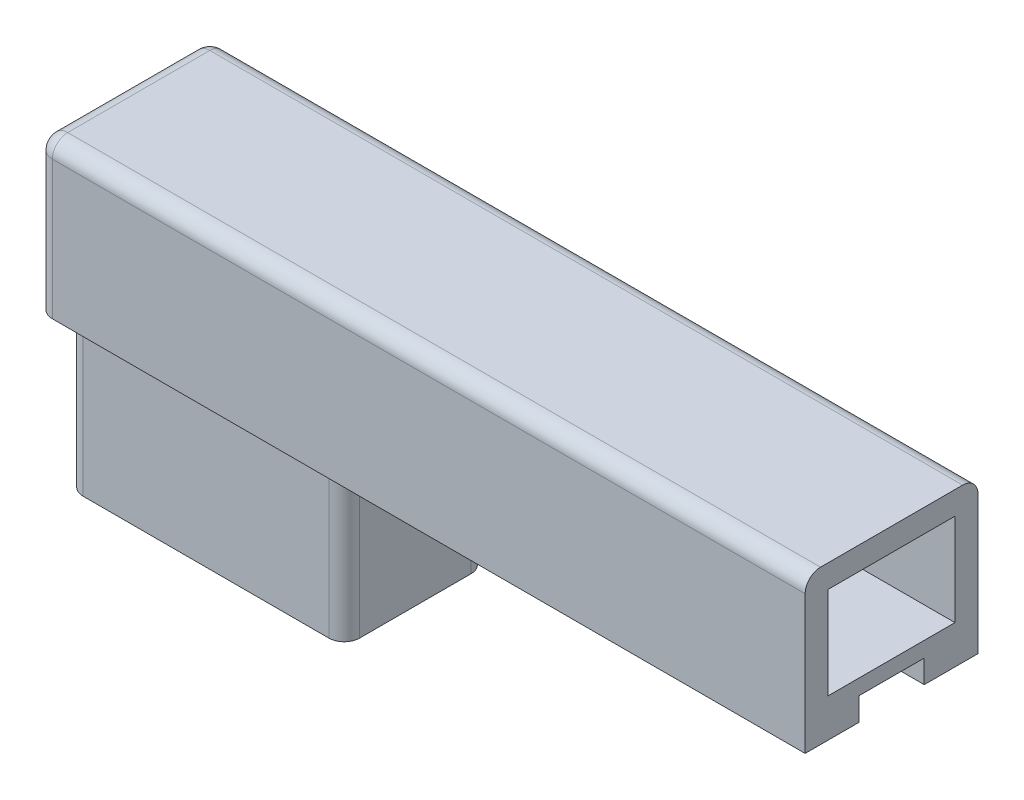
ISO-10303-21;
HEADER;
FILE_DESCRIPTION(('STEP AP214'),'2;1');
FILE_NAME('part.step','',(''),(''),'','','');
FILE_SCHEMA(('AUTOMOTIVE_DESIGN { 1 0 10303 214 1 1 1 1 }'));
ENDSEC;
DATA;
#1=APPLICATION_CONTEXT('core data for automotive mechanical design processes');
#2=APPLICATION_PROTOCOL_DEFINITION('international standard','automotive_design',2000,#1);
#3=PRODUCT_CONTEXT('',#1,'mechanical');
#4=PRODUCT('Part','Part','',(#3));
#5=PRODUCT_RELATED_PRODUCT_CATEGORY('part','',(#4));
#6=PRODUCT_DEFINITION_FORMATION('','',#4);
#7=PRODUCT_DEFINITION_CONTEXT('part definition',#1,'design');
#8=PRODUCT_DEFINITION('design','',#6,#7);
#9=PRODUCT_DEFINITION_SHAPE('','',#8);
#10=(LENGTH_UNIT() NAMED_UNIT(*) SI_UNIT(.MILLI.,.METRE.));
#11=(NAMED_UNIT(*) PLANE_ANGLE_UNIT() SI_UNIT($,.RADIAN.));
#12=(NAMED_UNIT(*) SI_UNIT($,.STERADIAN.) SOLID_ANGLE_UNIT());
#13=UNCERTAINTY_MEASURE_WITH_UNIT(LENGTH_MEASURE(1.E-05),#10,'distance_accuracy_value','');
#14=(GEOMETRIC_REPRESENTATION_CONTEXT(3) GLOBAL_UNCERTAINTY_ASSIGNED_CONTEXT((#13)) GLOBAL_UNIT_ASSIGNED_CONTEXT((#10,
#11,#12)) REPRESENTATION_CONTEXT('',''));
#15=CARTESIAN_POINT('',(0.,0.,0.));
#16=DIRECTION('',(0.,0.,1.));
#17=DIRECTION('',(1.,0.,0.));
#18=AXIS2_PLACEMENT_3D('',#15,#16,#17);
#19=CARTESIAN_POINT('',(36.,-40.,18.5));
#20=DIRECTION('',(-1.,0.,0.));
#21=DIRECTION('',(0.,0.,1.));
#22=AXIS2_PLACEMENT_3D('',#19,#20,#21);
#23=PLANE('',#22);
#24=DIRECTION('',(0.,0.,1.));
#25=VECTOR('',#24,1.);
#26=CARTESIAN_POINT('',(36.,-40.,18.5));
#27=LINE('',#26,#25);
#28=CARTESIAN_POINT('',(36.,-40.,-14.5));
#29=VERTEX_POINT('',#28);
#30=CARTESIAN_POINT('',(36.,-40.,14.5));
#31=VERTEX_POINT('',#30);
#32=EDGE_CURVE('E439',#29,#31,#27,.T.);
#33=ORIENTED_EDGE('',*,*,#32,.F.);
#34=DIRECTION('',(0.,1.,0.));
#35=VECTOR('',#34,1.);
#36=CARTESIAN_POINT('',(36.,-40.,-14.5));
#37=LINE('',#36,#35);
#38=CARTESIAN_POINT('',(36.,0.,-14.5));
#39=VERTEX_POINT('',#38);
#40=EDGE_CURVE('E549',#29,#39,#37,.T.);
#41=ORIENTED_EDGE('',*,*,#40,.T.);
#42=DIRECTION('',(0.,0.,1.));
#43=VECTOR('',#42,1.);
#44=CARTESIAN_POINT('',(36.,0.,18.5));
#45=LINE('',#44,#43);
#46=CARTESIAN_POINT('',(36.,0.,-8.5));
#47=VERTEX_POINT('',#46);
#48=EDGE_CURVE('E452',#39,#47,#45,.T.);
#49=ORIENTED_EDGE('',*,*,#48,.T.);
#50=DIRECTION('',(0.,-1.,0.));
#51=VECTOR('',#50,1.);
#52=CARTESIAN_POINT('',(36.,6.,-8.5));
#53=LINE('',#52,#51);
#54=CARTESIAN_POINT('',(36.,1.,-8.5));
#55=VERTEX_POINT('',#54);
#56=EDGE_CURVE('E332',#55,#47,#53,.T.);
#57=ORIENTED_EDGE('',*,*,#56,.F.);
#58=DIRECTION('',(0.,0.,-1.));
#59=VECTOR('',#58,1.);
#60=CARTESIAN_POINT('',(36.,1.,18.5));
#61=LINE('',#60,#59);
#62=CARTESIAN_POINT('',(36.,1.,8.5));
#63=VERTEX_POINT('',#62);
#64=EDGE_CURVE('E313',#63,#55,#61,.T.);
#65=ORIENTED_EDGE('',*,*,#64,.F.);
#66=DIRECTION('',(0.,-1.,0.));
#67=VECTOR('',#66,1.);
#68=CARTESIAN_POINT('',(36.,6.,8.5));
#69=LINE('',#68,#67);
#70=CARTESIAN_POINT('',(36.,0.,8.5));
#71=VERTEX_POINT('',#70);
#72=EDGE_CURVE('E335',#63,#71,#69,.T.);
#73=ORIENTED_EDGE('',*,*,#72,.T.);
#74=CARTESIAN_POINT('',(36.,0.,14.5));
#75=VERTEX_POINT('',#74);
#76=EDGE_CURVE('E451',#71,#75,#45,.T.);
#77=ORIENTED_EDGE('',*,*,#76,.T.);
#78=DIRECTION('',(0.,1.,0.));
#79=VECTOR('',#78,1.);
#80=CARTESIAN_POINT('',(36.,-40.,14.5));
#81=LINE('',#80,#79);
#82=EDGE_CURVE('E547',#75,#31,#81,.F.);
#83=ORIENTED_EDGE('',*,*,#82,.T.);
#84=EDGE_LOOP('',(#33,#41,#49,#57,#65,#73,#77,#83));
#85=FACE_BOUND('',#84,.T.);
#86=ADVANCED_FACE('F39',(#85),#23,.F.);
#87=CARTESIAN_POINT('',(32.,-40.,18.5));
#88=DIRECTION('',(-1.,0.,0.));
#89=DIRECTION('',(0.,0.,1.));
#90=AXIS2_PLACEMENT_3D('',#87,#88,#89);
#91=PLANE('',#90);
#92=DIRECTION('',(0.,1.,0.));
#93=VECTOR('',#92,1.);
#94=CARTESIAN_POINT('',(32.,-40.,14.5));
#95=LINE('',#94,#93);
#96=CARTESIAN_POINT('',(32.,-40.,14.5));
#97=VERTEX_POINT('',#96);
#98=CARTESIAN_POINT('',(32.,4.,14.5));
#99=VERTEX_POINT('',#98);
#100=EDGE_CURVE('E419',#97,#99,#95,.T.);
#101=ORIENTED_EDGE('',*,*,#100,.T.);
#102=DIRECTION('',(0.,0.,1.));
#103=VECTOR('',#102,1.);
#104=CARTESIAN_POINT('',(32.,4.,0.));
#105=LINE('',#104,#103);
#106=CARTESIAN_POINT('',(32.,4.,18.5));
#107=VERTEX_POINT('',#106);
#108=EDGE_CURVE('E374',#99,#107,#105,.T.);
#109=ORIENTED_EDGE('',*,*,#108,.T.);
#110=DIRECTION('',(0.,-1.,0.));
#111=VECTOR('',#110,1.);
#112=CARTESIAN_POINT('',(32.,73.2155881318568,18.5));
#113=LINE('',#112,#111);
#114=CARTESIAN_POINT('',(32.,36.,18.5));
#115=VERTEX_POINT('',#114);
#116=EDGE_CURVE('E363',#115,#107,#113,.T.);
#117=ORIENTED_EDGE('',*,*,#116,.F.);
#118=DIRECTION('',(0.,0.,-1.));
#119=VECTOR('',#118,1.);
#120=CARTESIAN_POINT('',(32.,36.,18.5));
#121=LINE('',#120,#119);
#122=CARTESIAN_POINT('',(32.,36.,-18.5));
#123=VERTEX_POINT('',#122);
#124=EDGE_CURVE('E370',#115,#123,#121,.T.);
#125=ORIENTED_EDGE('',*,*,#124,.T.);
#126=DIRECTION('',(0.,-1.,0.));
#127=VECTOR('',#126,1.);
#128=CARTESIAN_POINT('',(32.,73.2155881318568,-18.5));
#129=LINE('',#128,#127);
#130=CARTESIAN_POINT('',(32.,4.,-18.5));
#131=VERTEX_POINT('',#130);
#132=EDGE_CURVE('E372',#123,#131,#129,.T.);
#133=ORIENTED_EDGE('',*,*,#132,.T.);
#134=CARTESIAN_POINT('',(32.,4.,-14.5));
#135=VERTEX_POINT('',#134);
#136=EDGE_CURVE('E378',#131,#135,#105,.T.);
#137=ORIENTED_EDGE('',*,*,#136,.T.);
#138=DIRECTION('',(0.,1.,0.));
#139=VECTOR('',#138,1.);
#140=CARTESIAN_POINT('',(32.,-40.,-14.5));
#141=LINE('',#140,#139);
#142=CARTESIAN_POINT('',(32.,-40.,-14.5));
#143=VERTEX_POINT('',#142);
#144=EDGE_CURVE('E415',#143,#135,#141,.T.);
#145=ORIENTED_EDGE('',*,*,#144,.F.);
#146=DIRECTION('',(0.,0.,1.));
#147=VECTOR('',#146,1.);
#148=CARTESIAN_POINT('',(32.,-40.,18.5));
#149=LINE('',#148,#147);
#150=EDGE_CURVE('E428',#143,#97,#149,.T.);
#151=ORIENTED_EDGE('',*,*,#150,.T.);
#152=EDGE_LOOP('',(#101,#109,#117,#125,#133,#137,#145,#151));
#153=FACE_BOUND('',#152,.T.);
#154=DIRECTION('',(0.,0.,1.));
#155=VECTOR('',#154,1.);
#156=CARTESIAN_POINT('',(32.,20.,18.5));
#157=LINE('',#156,#155);
#158=CARTESIAN_POINT('',(32.,20.,-8.5));
#159=VERTEX_POINT('',#158);
#160=CARTESIAN_POINT('',(32.,20.,8.5));
#161=VERTEX_POINT('',#160);
#162=EDGE_CURVE('E289',#159,#161,#157,.T.);
#163=ORIENTED_EDGE('',*,*,#162,.T.);
#164=DIRECTION('',(0.,-1.,0.));
#165=VECTOR('',#164,1.);
#166=CARTESIAN_POINT('',(32.,-40.,8.5));
#167=LINE('',#166,#165);
#168=CARTESIAN_POINT('',(32.,1.,8.5));
#169=VERTEX_POINT('',#168);
#170=EDGE_CURVE('E307',#161,#169,#167,.T.);
#171=ORIENTED_EDGE('',*,*,#170,.T.);
#172=DIRECTION('',(0.,0.,-1.));
#173=VECTOR('',#172,1.);
#174=CARTESIAN_POINT('',(32.,1.,18.5));
#175=LINE('',#174,#173);
#176=CARTESIAN_POINT('',(32.,1.,-8.5));
#177=VERTEX_POINT('',#176);
#178=EDGE_CURVE('E310',#169,#177,#175,.T.);
#179=ORIENTED_EDGE('',*,*,#178,.T.);
#180=DIRECTION('',(0.,1.,0.));
#181=VECTOR('',#180,1.);
#182=CARTESIAN_POINT('',(32.,-40.,-8.50000000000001));
#183=LINE('',#182,#181);
#184=EDGE_CURVE('E305',#177,#159,#183,.T.);
#185=ORIENTED_EDGE('',*,*,#184,.T.);
#186=EDGE_LOOP('',(#163,#171,#179,#185));
#187=FACE_BOUND('',#186,.T.);
#188=ADVANCED_FACE('F598',(#153,#187),#91,.T.);
#189=CARTESIAN_POINT('',(0.,4.,0.));
#190=DIRECTION('',(0.,1.,0.));
#191=DIRECTION('',(0.,0.,1.));
#192=AXIS2_PLACEMENT_3D('',#189,#190,#191);
#193=PLANE('',#192);
#194=ORIENTED_EDGE('',*,*,#136,.F.);
#195=DIRECTION('',(-1.,0.,0.));
#196=VECTOR('',#195,1.);
#197=CARTESIAN_POINT('',(160.,4.,-18.5));
#198=LINE('',#197,#196);
#199=CARTESIAN_POINT('',(-36.,4.,-18.5));
#200=VERTEX_POINT('',#199);
#201=EDGE_CURVE('E384',#131,#200,#198,.T.);
#202=ORIENTED_EDGE('',*,*,#201,.T.);
#203=DIRECTION('',(0.,0.,1.));
#204=VECTOR('',#203,1.);
#205=CARTESIAN_POINT('',(-36.,4.,22.5));
#206=LINE('',#205,#204);
#207=CARTESIAN_POINT('',(-36.,4.,18.5));
#208=VERTEX_POINT('',#207);
#209=EDGE_CURVE('E379',#200,#208,#206,.T.);
#210=ORIENTED_EDGE('',*,*,#209,.T.);
#211=DIRECTION('',(1.,0.,0.));
#212=VECTOR('',#211,1.);
#213=CARTESIAN_POINT('',(160.,4.,18.5));
#214=LINE('',#213,#212);
#215=EDGE_CURVE('E382',#208,#107,#214,.T.);
#216=ORIENTED_EDGE('',*,*,#215,.T.);
#217=ORIENTED_EDGE('',*,*,#108,.F.);
#218=DIRECTION('',(-1.,0.,0.));
#219=VECTOR('',#218,1.);
#220=CARTESIAN_POINT('',(0.,4.,14.5));
#221=LINE('',#220,#219);
#222=CARTESIAN_POINT('',(-32.,4.,14.5));
#223=VERTEX_POINT('',#222);
#224=EDGE_CURVE('E393',#99,#223,#221,.T.);
#225=ORIENTED_EDGE('',*,*,#224,.T.);
#226=DIRECTION('',(0.,0.,-1.));
#227=VECTOR('',#226,1.);
#228=CARTESIAN_POINT('',(-32.,4.,0.));
#229=LINE('',#228,#227);
#230=CARTESIAN_POINT('',(-32.,4.,-14.5));
#231=VERTEX_POINT('',#230);
#232=EDGE_CURVE('E389',#223,#231,#229,.T.);
#233=ORIENTED_EDGE('',*,*,#232,.T.);
#234=DIRECTION('',(1.,0.,0.));
#235=VECTOR('',#234,1.);
#236=CARTESIAN_POINT('',(0.,4.,-14.5));
#237=LINE('',#236,#235);
#238=EDGE_CURVE('E392',#231,#135,#237,.T.);
#239=ORIENTED_EDGE('',*,*,#238,.T.);
#240=EDGE_LOOP('',(#194,#202,#210,#216,#217,#225,#233,#239));
#241=FACE_BOUND('',#240,.T.);
#242=ADVANCED_FACE('F603',(#241),#193,.T.);
#243=CARTESIAN_POINT('',(160.,40.,18.5));
#244=DIRECTION('',(0.,0.,-1.));
#245=DIRECTION('',(-1.,0.,0.));
#246=AXIS2_PLACEMENT_3D('',#243,#244,#245);
#247=PLANE('',#246);
#248=ORIENTED_EDGE('',*,*,#116,.T.);
#249=ORIENTED_EDGE('',*,*,#215,.F.);
#250=DIRECTION('',(0.,-1.,0.));
#251=VECTOR('',#250,1.);
#252=CARTESIAN_POINT('',(-36.,40.,18.5));
#253=LINE('',#252,#251);
#254=CARTESIAN_POINT('',(-36.,36.,18.5));
#255=VERTEX_POINT('',#254);
#256=EDGE_CURVE('E399',#255,#208,#253,.T.);
#257=ORIENTED_EDGE('',*,*,#256,.F.);
#258=DIRECTION('',(1.,0.,0.));
#259=VECTOR('',#258,1.);
#260=CARTESIAN_POINT('',(160.,36.,18.5));
#261=LINE('',#260,#259);
#262=EDGE_CURVE('E406',#255,#115,#261,.T.);
#263=ORIENTED_EDGE('',*,*,#262,.T.);
#264=EDGE_LOOP('',(#248,#249,#257,#263));
#265=FACE_BOUND('',#264,.T.);
#266=ADVANCED_FACE('F741',(#265),#247,.T.);
#267=CARTESIAN_POINT('',(160.,40.,-18.5));
#268=DIRECTION('',(0.,0.,1.));
#269=DIRECTION('',(1.,0.,0.));
#270=AXIS2_PLACEMENT_3D('',#267,#268,#269);
#271=PLANE('',#270);
#272=ORIENTED_EDGE('',*,*,#132,.F.);
#273=DIRECTION('',(-1.,0.,0.));
#274=VECTOR('',#273,1.);
#275=CARTESIAN_POINT('',(160.,36.,-18.5));
#276=LINE('',#275,#274);
#277=CARTESIAN_POINT('',(-36.,36.,-18.5));
#278=VERTEX_POINT('',#277);
#279=EDGE_CURVE('E409',#123,#278,#276,.T.);
#280=ORIENTED_EDGE('',*,*,#279,.T.);
#281=DIRECTION('',(0.,-1.,0.));
#282=VECTOR('',#281,1.);
#283=CARTESIAN_POINT('',(-36.,40.,-18.5));
#284=LINE('',#283,#282);
#285=EDGE_CURVE('E403',#278,#200,#284,.T.);
#286=ORIENTED_EDGE('',*,*,#285,.T.);
#287=ORIENTED_EDGE('',*,*,#201,.F.);
#288=EDGE_LOOP('',(#272,#280,#286,#287));
#289=FACE_BOUND('',#288,.T.);
#290=ADVANCED_FACE('F750',(#289),#271,.T.);
#291=CARTESIAN_POINT('',(0.,36.,0.));
#292=DIRECTION('',(0.,1.,0.));
#293=DIRECTION('',(0.,0.,1.));
#294=AXIS2_PLACEMENT_3D('',#291,#292,#293);
#295=PLANE('',#294);
#296=ORIENTED_EDGE('',*,*,#279,.F.);
#297=ORIENTED_EDGE('',*,*,#124,.F.);
#298=ORIENTED_EDGE('',*,*,#262,.F.);
#299=DIRECTION('',(0.,0.,1.));
#300=VECTOR('',#299,1.);
#301=CARTESIAN_POINT('',(-36.,36.,22.5));
#302=LINE('',#301,#300);
#303=EDGE_CURVE('E386',#278,#255,#302,.T.);
#304=ORIENTED_EDGE('',*,*,#303,.F.);
#305=EDGE_LOOP('',(#296,#297,#298,#304));
#306=FACE_BOUND('',#305,.T.);
#307=ADVANCED_FACE('F621',(#306),#295,.F.);
#308=CARTESIAN_POINT('',(0.,0.,0.));
#309=DIRECTION('',(0.,1.,0.));
#310=DIRECTION('',(0.,0.,1.));
#311=AXIS2_PLACEMENT_3D('',#308,#309,#310);
#312=PLANE('',#311);
#313=DIRECTION('',(0.,0.,1.));
#314=VECTOR('',#313,1.);
#315=CARTESIAN_POINT('',(-40.,0.,22.5));
#316=LINE('',#315,#314);
#317=CARTESIAN_POINT('',(-40.,0.,-18.5));
#318=VERTEX_POINT('',#317);
#319=CARTESIAN_POINT('',(-40.,0.,18.5));
#320=VERTEX_POINT('',#319);
#321=EDGE_CURVE('E445',#318,#320,#316,.T.);
#322=ORIENTED_EDGE('',*,*,#321,.F.);
#323=CARTESIAN_POINT('',(-36.,0.,-18.5));
#324=DIRECTION('',(0.,1.,0.));
#325=DIRECTION('',(0.,0.,1.));
#326=AXIS2_PLACEMENT_3D('',#323,#324,#325);
#327=CIRCLE('',#326,4.);
#328=CARTESIAN_POINT('',(-36.,0.,-22.5));
#329=VERTEX_POINT('',#328);
#330=EDGE_CURVE('E485',#318,#329,#327,.F.);
#331=ORIENTED_EDGE('',*,*,#330,.T.);
#332=DIRECTION('',(-1.,0.,0.));
#333=VECTOR('',#332,1.);
#334=CARTESIAN_POINT('',(160.,0.,-22.5));
#335=LINE('',#334,#333);
#336=CARTESIAN_POINT('',(160.,0.,-22.5));
#337=VERTEX_POINT('',#336);
#338=EDGE_CURVE('E460',#337,#329,#335,.T.);
#339=ORIENTED_EDGE('',*,*,#338,.F.);
#340=DIRECTION('',(0.,0.,-1.));
#341=VECTOR('',#340,1.);
#342=CARTESIAN_POINT('',(160.,0.,22.5));
#343=LINE('',#342,#341);
#344=CARTESIAN_POINT('',(160.,0.,-8.5));
#345=VERTEX_POINT('',#344);
#346=EDGE_CURVE('E466',#345,#337,#343,.T.);
#347=ORIENTED_EDGE('',*,*,#346,.F.);
#348=DIRECTION('',(1.,0.,0.));
#349=VECTOR('',#348,1.);
#350=CARTESIAN_POINT('',(36.,0.,-8.5));
#351=LINE('',#350,#349);
#352=EDGE_CURVE('E320',#47,#345,#351,.T.);
#353=ORIENTED_EDGE('',*,*,#352,.F.);
#354=ORIENTED_EDGE('',*,*,#48,.F.);
#355=CARTESIAN_POINT('',(32.,0.,-14.5));
#356=DIRECTION('',(0.,1.,0.));
#357=DIRECTION('',(0.,0.,1.));
#358=AXIS2_PLACEMENT_3D('',#355,#356,#357);
#359=CIRCLE('',#358,4.);
#360=CARTESIAN_POINT('',(32.,0.,-18.5));
#361=VERTEX_POINT('',#360);
#362=EDGE_CURVE('E47',#39,#361,#359,.T.);
#363=ORIENTED_EDGE('',*,*,#362,.T.);
#364=DIRECTION('',(1.,0.,0.));
#365=VECTOR('',#364,1.);
#366=CARTESIAN_POINT('',(-36.,0.,-18.5));
#367=LINE('',#366,#365);
#368=CARTESIAN_POINT('',(-32.,0.,-18.5));
#369=VERTEX_POINT('',#368);
#370=EDGE_CURVE('E448',#369,#361,#367,.T.);
#371=ORIENTED_EDGE('',*,*,#370,.F.);
#372=CARTESIAN_POINT('',(-32.,0.,-14.5));
#373=DIRECTION('',(0.,1.,0.));
#374=DIRECTION('',(0.,0.,1.));
#375=AXIS2_PLACEMENT_3D('',#372,#373,#374);
#376=CIRCLE('',#375,4.);
#377=CARTESIAN_POINT('',(-36.,0.,-14.5));
#378=VERTEX_POINT('',#377);
#379=EDGE_CURVE('E553',#369,#378,#376,.T.);
#380=ORIENTED_EDGE('',*,*,#379,.T.);
#381=DIRECTION('',(0.,0.,-1.));
#382=VECTOR('',#381,1.);
#383=CARTESIAN_POINT('',(-36.,0.,18.5));
#384=LINE('',#383,#382);
#385=CARTESIAN_POINT('',(-36.,0.,14.5));
#386=VERTEX_POINT('',#385);
#387=EDGE_CURVE('E402',#386,#378,#384,.T.);
#388=ORIENTED_EDGE('',*,*,#387,.F.);
#389=CARTESIAN_POINT('',(-32.,0.,14.5));
#390=DIRECTION('',(0.,1.,0.));
#391=DIRECTION('',(0.,0.,1.));
#392=AXIS2_PLACEMENT_3D('',#389,#390,#391);
#393=CIRCLE('',#392,4.);
#394=CARTESIAN_POINT('',(-32.,0.,18.5));
#395=VERTEX_POINT('',#394);
#396=EDGE_CURVE('E551',#386,#395,#393,.T.);
#397=ORIENTED_EDGE('',*,*,#396,.T.);
#398=DIRECTION('',(-1.,0.,0.));
#399=VECTOR('',#398,1.);
#400=CARTESIAN_POINT('',(-36.,0.,18.5));
#401=LINE('',#400,#399);
#402=CARTESIAN_POINT('',(32.,0.,18.5));
#403=VERTEX_POINT('',#402);
#404=EDGE_CURVE('E436',#403,#395,#401,.T.);
#405=ORIENTED_EDGE('',*,*,#404,.F.);
#406=CARTESIAN_POINT('',(32.,0.,14.5));
#407=DIRECTION('',(0.,1.,0.));
#408=DIRECTION('',(0.,0.,1.));
#409=AXIS2_PLACEMENT_3D('',#406,#407,#408);
#410=CIRCLE('',#409,4.);
#411=EDGE_CURVE('E11',#403,#75,#410,.T.);
#412=ORIENTED_EDGE('',*,*,#411,.T.);
#413=ORIENTED_EDGE('',*,*,#76,.F.);
#414=DIRECTION('',(-1.,0.,0.));
#415=VECTOR('',#414,1.);
#416=CARTESIAN_POINT('',(36.,0.,8.5));
#417=LINE('',#416,#415);
#418=CARTESIAN_POINT('',(160.,0.,8.5));
#419=VERTEX_POINT('',#418);
#420=EDGE_CURVE('E315',#419,#71,#417,.T.);
#421=ORIENTED_EDGE('',*,*,#420,.F.);
#422=CARTESIAN_POINT('',(160.,0.,22.5));
#423=VERTEX_POINT('',#422);
#424=EDGE_CURVE('E467',#423,#419,#343,.T.);
#425=ORIENTED_EDGE('',*,*,#424,.F.);
#426=DIRECTION('',(1.,0.,0.));
#427=VECTOR('',#426,1.);
#428=CARTESIAN_POINT('',(160.,0.,22.5));
#429=LINE('',#428,#427);
#430=CARTESIAN_POINT('',(-36.,0.,22.5));
#431=VERTEX_POINT('',#430);
#432=EDGE_CURVE('E463',#431,#423,#429,.T.);
#433=ORIENTED_EDGE('',*,*,#432,.F.);
#434=CARTESIAN_POINT('',(-36.,0.,18.5));
#435=DIRECTION('',(0.,1.,0.));
#436=DIRECTION('',(0.,0.,1.));
#437=AXIS2_PLACEMENT_3D('',#434,#435,#436);
#438=CIRCLE('',#437,4.);
#439=EDGE_CURVE('E483',#431,#320,#438,.F.);
#440=ORIENTED_EDGE('',*,*,#439,.T.);
#441=EDGE_LOOP('',(#322,#331,#339,#347,#353,#354,#363,#371,#380,#388,#397,#405,#412,#413,#421,
#425,#433,#440));
#442=FACE_BOUND('',#441,.T.);
#443=ADVANCED_FACE('F557',(#442),#312,.F.);
#444=CARTESIAN_POINT('',(-40.,40.,22.5));
#445=DIRECTION('',(1.,0.,0.));
#446=DIRECTION('',(0.,0.,-1.));
#447=AXIS2_PLACEMENT_3D('',#444,#445,#446);
#448=PLANE('',#447);
#449=DIRECTION('',(0.,-1.,0.));
#450=VECTOR('',#449,1.);
#451=CARTESIAN_POINT('',(-40.,40.,18.5));
#452=LINE('',#451,#450);
#453=CARTESIAN_POINT('',(-40.,36.,18.5));
#454=VERTEX_POINT('',#453);
#455=EDGE_CURVE('E478',#320,#454,#452,.F.);
#456=ORIENTED_EDGE('',*,*,#455,.T.);
#457=DIRECTION('',(0.,0.,1.));
#458=VECTOR('',#457,1.);
#459=CARTESIAN_POINT('',(-40.,36.,-18.5));
#460=LINE('',#459,#458);
#461=CARTESIAN_POINT('',(-40.,36.,-18.5));
#462=VERTEX_POINT('',#461);
#463=EDGE_CURVE('E507',#454,#462,#460,.F.);
#464=ORIENTED_EDGE('',*,*,#463,.T.);
#465=DIRECTION('',(0.,-1.,0.));
#466=VECTOR('',#465,1.);
#467=CARTESIAN_POINT('',(-40.,40.,-18.5));
#468=LINE('',#467,#466);
#469=EDGE_CURVE('E481',#462,#318,#468,.T.);
#470=ORIENTED_EDGE('',*,*,#469,.T.);
#471=ORIENTED_EDGE('',*,*,#321,.T.);
#472=EDGE_LOOP('',(#456,#464,#470,#471));
#473=FACE_BOUND('',#472,.T.);
#474=ADVANCED_FACE('F620',(#473),#448,.F.);
#475=CARTESIAN_POINT('',(160.,40.,22.5));
#476=DIRECTION('',(0.,0.,-1.));
#477=DIRECTION('',(-1.,0.,0.));
#478=AXIS2_PLACEMENT_3D('',#475,#476,#477);
#479=PLANE('',#478);
#480=DIRECTION('',(0.,-1.,0.));
#481=VECTOR('',#480,1.);
#482=CARTESIAN_POINT('',(160.,40.,22.5));
#483=LINE('',#482,#481);
#484=CARTESIAN_POINT('',(160.,36.,22.5));
#485=VERTEX_POINT('',#484);
#486=EDGE_CURVE('E473',#485,#423,#483,.T.);
#487=ORIENTED_EDGE('',*,*,#486,.F.);
#488=DIRECTION('',(1.,0.,0.));
#489=VECTOR('',#488,1.);
#490=CARTESIAN_POINT('',(-36.,36.,22.5));
#491=LINE('',#490,#489);
#492=CARTESIAN_POINT('',(-36.,36.,22.5));
#493=VERTEX_POINT('',#492);
#494=EDGE_CURVE('E511',#485,#493,#491,.F.);
#495=ORIENTED_EDGE('',*,*,#494,.T.);
#496=DIRECTION('',(0.,-1.,0.));
#497=VECTOR('',#496,1.);
#498=CARTESIAN_POINT('',(-36.,40.,22.5));
#499=LINE('',#498,#497);
#500=EDGE_CURVE('E490',#493,#431,#499,.T.);
#501=ORIENTED_EDGE('',*,*,#500,.T.);
#502=ORIENTED_EDGE('',*,*,#432,.T.);
#503=EDGE_LOOP('',(#487,#495,#501,#502));
#504=FACE_BOUND('',#503,.T.);
#505=ADVANCED_FACE('F628',(#504),#479,.F.);
#506=CARTESIAN_POINT('',(160.,40.,22.5));
#507=DIRECTION('',(-1.,0.,0.));
#508=DIRECTION('',(0.,0.,1.));
#509=AXIS2_PLACEMENT_3D('',#506,#507,#508);
#510=PLANE('',#509);
#511=DIRECTION('',(0.,0.,-1.));
#512=VECTOR('',#511,1.);
#513=CARTESIAN_POINT('',(160.,10.,16.5));
#514=LINE('',#513,#512);
#515=CARTESIAN_POINT('',(160.,10.,16.5));
#516=VERTEX_POINT('',#515);
#517=CARTESIAN_POINT('',(160.,10.,-16.5));
#518=VERTEX_POINT('',#517);
#519=EDGE_CURVE('E353',#516,#518,#514,.T.);
#520=ORIENTED_EDGE('',*,*,#519,.F.);
#521=DIRECTION('',(0.,-1.,0.));
#522=VECTOR('',#521,1.);
#523=CARTESIAN_POINT('',(160.,34.,16.5));
#524=LINE('',#523,#522);
#525=CARTESIAN_POINT('',(160.,34.,16.5));
#526=VERTEX_POINT('',#525);
#527=EDGE_CURVE('E331',#526,#516,#524,.T.);
#528=ORIENTED_EDGE('',*,*,#527,.F.);
#529=DIRECTION('',(0.,0.,1.));
#530=VECTOR('',#529,1.);
#531=CARTESIAN_POINT('',(160.,34.,-16.5));
#532=LINE('',#531,#530);
#533=CARTESIAN_POINT('',(160.,34.,-16.5));
#534=VERTEX_POINT('',#533);
#535=EDGE_CURVE('E342',#534,#526,#532,.T.);
#536=ORIENTED_EDGE('',*,*,#535,.F.);
#537=DIRECTION('',(0.,1.,0.));
#538=VECTOR('',#537,1.);
#539=CARTESIAN_POINT('',(160.,10.,-16.5));
#540=LINE('',#539,#538);
#541=EDGE_CURVE('E356',#518,#534,#540,.T.);
#542=ORIENTED_EDGE('',*,*,#541,.F.);
#543=EDGE_LOOP('',(#520,#528,#536,#542));
#544=FACE_BOUND('',#543,.T.);
#545=DIRECTION('',(0.,-1.,0.));
#546=VECTOR('',#545,1.);
#547=CARTESIAN_POINT('',(160.,40.,-22.5));
#548=LINE('',#547,#546);
#549=CARTESIAN_POINT('',(160.,36.,-22.5));
#550=VERTEX_POINT('',#549);
#551=EDGE_CURVE('E459',#550,#337,#548,.T.);
#552=ORIENTED_EDGE('',*,*,#551,.F.);
#553=CARTESIAN_POINT('',(160.,36.,-18.5));
#554=DIRECTION('',(-1.,0.,0.));
#555=DIRECTION('',(0.,0.,1.));
#556=AXIS2_PLACEMENT_3D('',#553,#554,#555);
#557=CIRCLE('',#556,4.);
#558=CARTESIAN_POINT('',(160.,40.,-18.5));
#559=VERTEX_POINT('',#558);
#560=EDGE_CURVE('E503',#550,#559,#557,.F.);
#561=ORIENTED_EDGE('',*,*,#560,.T.);
#562=DIRECTION('',(0.,0.,-1.));
#563=VECTOR('',#562,1.);
#564=CARTESIAN_POINT('',(160.,40.,22.5));
#565=LINE('',#564,#563);
#566=CARTESIAN_POINT('',(160.,40.,18.5));
#567=VERTEX_POINT('',#566);
#568=EDGE_CURVE('E456',#567,#559,#565,.T.);
#569=ORIENTED_EDGE('',*,*,#568,.F.);
#570=CARTESIAN_POINT('',(160.,36.,18.5));
#571=DIRECTION('',(-1.,0.,0.));
#572=DIRECTION('',(0.,0.,1.));
#573=AXIS2_PLACEMENT_3D('',#570,#571,#572);
#574=CIRCLE('',#573,4.);
#575=EDGE_CURVE('E501',#567,#485,#574,.F.);
#576=ORIENTED_EDGE('',*,*,#575,.T.);
#577=ORIENTED_EDGE('',*,*,#486,.T.);
#578=ORIENTED_EDGE('',*,*,#424,.T.);
#579=DIRECTION('',(0.,-1.,0.));
#580=VECTOR('',#579,1.);
#581=CARTESIAN_POINT('',(160.,6.,8.5));
#582=LINE('',#581,#580);
#583=CARTESIAN_POINT('',(160.,6.,8.5));
#584=VERTEX_POINT('',#583);
#585=EDGE_CURVE('E324',#584,#419,#582,.T.);
#586=ORIENTED_EDGE('',*,*,#585,.F.);
#587=DIRECTION('',(0.,0.,1.));
#588=VECTOR('',#587,1.);
#589=CARTESIAN_POINT('',(160.,6.,8.5));
#590=LINE('',#589,#588);
#591=CARTESIAN_POINT('',(160.,6.,-8.5));
#592=VERTEX_POINT('',#591);
#593=EDGE_CURVE('E316',#592,#584,#590,.T.);
#594=ORIENTED_EDGE('',*,*,#593,.F.);
#595=DIRECTION('',(0.,-1.,0.));
#596=VECTOR('',#595,1.);
#597=CARTESIAN_POINT('',(160.,6.,-8.5));
#598=LINE('',#597,#596);
#599=EDGE_CURVE('E328',#592,#345,#598,.T.);
#600=ORIENTED_EDGE('',*,*,#599,.T.);
#601=ORIENTED_EDGE('',*,*,#346,.T.);
#602=EDGE_LOOP('',(#552,#561,#569,#576,#577,#578,#586,#594,#600,#601));
#603=FACE_BOUND('',#602,.T.);
#604=ADVANCED_FACE('F624',(#544,#603),#510,.F.);
#605=CARTESIAN_POINT('',(160.,40.,-22.5));
#606=DIRECTION('',(0.,0.,1.));
#607=DIRECTION('',(1.,0.,0.));
#608=AXIS2_PLACEMENT_3D('',#605,#606,#607);
#609=PLANE('',#608);
#610=DIRECTION('',(0.,-1.,0.));
#611=VECTOR('',#610,1.);
#612=CARTESIAN_POINT('',(-36.,40.,-22.5));
#613=LINE('',#612,#611);
#614=CARTESIAN_POINT('',(-36.,36.,-22.5));
#615=VERTEX_POINT('',#614);
#616=EDGE_CURVE('E487',#329,#615,#613,.F.);
#617=ORIENTED_EDGE('',*,*,#616,.T.);
#618=DIRECTION('',(-1.,0.,0.));
#619=VECTOR('',#618,1.);
#620=CARTESIAN_POINT('',(160.,36.,-22.5));
#621=LINE('',#620,#619);
#622=EDGE_CURVE('E499',#615,#550,#621,.F.);
#623=ORIENTED_EDGE('',*,*,#622,.T.);
#624=ORIENTED_EDGE('',*,*,#551,.T.);
#625=ORIENTED_EDGE('',*,*,#338,.T.);
#626=EDGE_LOOP('',(#617,#623,#624,#625));
#627=FACE_BOUND('',#626,.T.);
#628=ADVANCED_FACE('F616',(#627),#609,.F.);
#629=CARTESIAN_POINT('',(0.,40.,0.));
#630=DIRECTION('',(0.,1.,0.));
#631=DIRECTION('',(0.,0.,1.));
#632=AXIS2_PLACEMENT_3D('',#629,#630,#631);
#633=PLANE('',#632);
#634=ORIENTED_EDGE('',*,*,#568,.T.);
#635=DIRECTION('',(-1.,0.,0.));
#636=VECTOR('',#635,1.);
#637=CARTESIAN_POINT('',(-36.,40.,-18.5));
#638=LINE('',#637,#636);
#639=CARTESIAN_POINT('',(-36.,40.,-18.5));
#640=VERTEX_POINT('',#639);
#641=EDGE_CURVE('E496',#559,#640,#638,.T.);
#642=ORIENTED_EDGE('',*,*,#641,.T.);
#643=DIRECTION('',(0.,0.,1.));
#644=VECTOR('',#643,1.);
#645=CARTESIAN_POINT('',(-36.,40.,18.5));
#646=LINE('',#645,#644);
#647=CARTESIAN_POINT('',(-36.,40.,18.5));
#648=VERTEX_POINT('',#647);
#649=EDGE_CURVE('E494',#640,#648,#646,.T.);
#650=ORIENTED_EDGE('',*,*,#649,.T.);
#651=DIRECTION('',(1.,0.,0.));
#652=VECTOR('',#651,1.);
#653=CARTESIAN_POINT('',(160.,40.,18.5));
#654=LINE('',#653,#652);
#655=EDGE_CURVE('E492',#648,#567,#654,.T.);
#656=ORIENTED_EDGE('',*,*,#655,.T.);
#657=EDGE_LOOP('',(#634,#642,#650,#656));
#658=FACE_BOUND('',#657,.T.);
#659=ADVANCED_FACE('F613',(#658),#633,.T.);
#660=CARTESIAN_POINT('',(-36.,-40.,18.5));
#661=DIRECTION('',(1.,0.,0.));
#662=DIRECTION('',(0.,0.,-1.));
#663=AXIS2_PLACEMENT_3D('',#660,#661,#662);
#664=PLANE('',#663);
#665=DIRECTION('',(0.,0.,-1.));
#666=VECTOR('',#665,1.);
#667=CARTESIAN_POINT('',(-36.,-40.,18.5));
#668=LINE('',#667,#666);
#669=CARTESIAN_POINT('',(-36.,-40.,14.5));
#670=VERTEX_POINT('',#669);
#671=CARTESIAN_POINT('',(-36.,-40.,-14.5));
#672=VERTEX_POINT('',#671);
#673=EDGE_CURVE('E432',#670,#672,#668,.T.);
#674=ORIENTED_EDGE('',*,*,#673,.F.);
#675=DIRECTION('',(0.,1.,0.));
#676=VECTOR('',#675,1.);
#677=CARTESIAN_POINT('',(-36.,-40.,14.5));
#678=LINE('',#677,#676);
#679=EDGE_CURVE('E526',#670,#386,#678,.T.);
#680=ORIENTED_EDGE('',*,*,#679,.T.);
#681=ORIENTED_EDGE('',*,*,#387,.T.);
#682=DIRECTION('',(0.,1.,0.));
#683=VECTOR('',#682,1.);
#684=CARTESIAN_POINT('',(-36.,-40.,-14.5));
#685=LINE('',#684,#683);
#686=EDGE_CURVE('E513',#378,#672,#685,.F.);
#687=ORIENTED_EDGE('',*,*,#686,.T.);
#688=EDGE_LOOP('',(#674,#680,#681,#687));
#689=FACE_BOUND('',#688,.T.);
#690=ADVANCED_FACE('F584',(#689),#664,.F.);
#691=CARTESIAN_POINT('',(-36.,-40.,-18.5));
#692=DIRECTION('',(0.,0.,1.));
#693=DIRECTION('',(1.,0.,0.));
#694=AXIS2_PLACEMENT_3D('',#691,#692,#693);
#695=PLANE('',#694);
#696=DIRECTION('',(1.,0.,0.));
#697=VECTOR('',#696,1.);
#698=CARTESIAN_POINT('',(-36.,-40.,-18.5));
#699=LINE('',#698,#697);
#700=CARTESIAN_POINT('',(-32.,-40.,-18.5));
#701=VERTEX_POINT('',#700);
#702=CARTESIAN_POINT('',(32.,-40.,-18.5));
#703=VERTEX_POINT('',#702);
#704=EDGE_CURVE('E435',#701,#703,#699,.T.);
#705=ORIENTED_EDGE('',*,*,#704,.F.);
#706=DIRECTION('',(0.,1.,0.));
#707=VECTOR('',#706,1.);
#708=CARTESIAN_POINT('',(-32.,-40.,-18.5));
#709=LINE('',#708,#707);
#710=EDGE_CURVE('E544',#701,#369,#709,.T.);
#711=ORIENTED_EDGE('',*,*,#710,.T.);
#712=ORIENTED_EDGE('',*,*,#370,.T.);
#713=DIRECTION('',(0.,1.,0.));
#714=VECTOR('',#713,1.);
#715=CARTESIAN_POINT('',(32.,-40.,-18.5));
#716=LINE('',#715,#714);
#717=EDGE_CURVE('E542',#361,#703,#716,.F.);
#718=ORIENTED_EDGE('',*,*,#717,.T.);
#719=EDGE_LOOP('',(#705,#711,#712,#718));
#720=FACE_BOUND('',#719,.T.);
#721=ADVANCED_FACE('F561',(#720),#695,.F.);
#722=CARTESIAN_POINT('',(-36.,-40.,18.5));
#723=DIRECTION('',(0.,0.,-1.));
#724=DIRECTION('',(-1.,0.,0.));
#725=AXIS2_PLACEMENT_3D('',#722,#723,#724);
#726=PLANE('',#725);
#727=ORIENTED_EDGE('',*,*,#404,.T.);
#728=DIRECTION('',(0.,1.,0.));
#729=VECTOR('',#728,1.);
#730=CARTESIAN_POINT('',(-32.,-40.,18.5));
#731=LINE('',#730,#729);
#732=CARTESIAN_POINT('',(-32.,-40.,18.5));
#733=VERTEX_POINT('',#732);
#734=EDGE_CURVE('E532',#395,#733,#731,.F.);
#735=ORIENTED_EDGE('',*,*,#734,.T.);
#736=DIRECTION('',(-1.,0.,0.));
#737=VECTOR('',#736,1.);
#738=CARTESIAN_POINT('',(-36.,-40.,18.5));
#739=LINE('',#738,#737);
#740=CARTESIAN_POINT('',(32.,-40.,18.5));
#741=VERTEX_POINT('',#740);
#742=EDGE_CURVE('E442',#741,#733,#739,.T.);
#743=ORIENTED_EDGE('',*,*,#742,.F.);
#744=DIRECTION('',(0.,1.,0.));
#745=VECTOR('',#744,1.);
#746=CARTESIAN_POINT('',(32.,-40.,18.5));
#747=LINE('',#746,#745);
#748=EDGE_CURVE('E529',#741,#403,#747,.T.);
#749=ORIENTED_EDGE('',*,*,#748,.T.);
#750=EDGE_LOOP('',(#727,#735,#743,#749));
#751=FACE_BOUND('',#750,.T.);
#752=ADVANCED_FACE('F576',(#751),#726,.F.);
#753=CARTESIAN_POINT('',(0.,-40.,0.));
#754=DIRECTION('',(0.,-1.,0.));
#755=DIRECTION('',(0.,0.,-1.));
#756=AXIS2_PLACEMENT_3D('',#753,#754,#755);
#757=PLANE('',#756);
#758=DIRECTION('',(-1.,0.,0.));
#759=VECTOR('',#758,1.);
#760=CARTESIAN_POINT('',(-36.,-40.,14.5));
#761=LINE('',#760,#759);
#762=CARTESIAN_POINT('',(-32.,-40.,14.5));
#763=VERTEX_POINT('',#762);
#764=EDGE_CURVE('E420',#97,#763,#761,.T.);
#765=ORIENTED_EDGE('',*,*,#764,.F.);
#766=ORIENTED_EDGE('',*,*,#150,.F.);
#767=DIRECTION('',(1.,0.,0.));
#768=VECTOR('',#767,1.);
#769=CARTESIAN_POINT('',(-36.,-40.,-14.5));
#770=LINE('',#769,#768);
#771=CARTESIAN_POINT('',(-32.,-40.,-14.5));
#772=VERTEX_POINT('',#771);
#773=EDGE_CURVE('E426',#772,#143,#770,.T.);
#774=ORIENTED_EDGE('',*,*,#773,.F.);
#775=DIRECTION('',(0.,0.,-1.));
#776=VECTOR('',#775,1.);
#777=CARTESIAN_POINT('',(-32.,-40.,18.5));
#778=LINE('',#777,#776);
#779=EDGE_CURVE('E396',#763,#772,#778,.T.);
#780=ORIENTED_EDGE('',*,*,#779,.F.);
#781=EDGE_LOOP('',(#765,#766,#774,#780));
#782=FACE_BOUND('',#781,.T.);
#783=ORIENTED_EDGE('',*,*,#742,.T.);
#784=CARTESIAN_POINT('',(-32.,-40.,14.5));
#785=DIRECTION('',(0.,-1.,0.));
#786=DIRECTION('',(0.,0.,-1.));
#787=AXIS2_PLACEMENT_3D('',#784,#785,#786);
#788=CIRCLE('',#787,4.);
#789=EDGE_CURVE('E540',#733,#670,#788,.T.);
#790=ORIENTED_EDGE('',*,*,#789,.T.);
#791=ORIENTED_EDGE('',*,*,#673,.T.);
#792=CARTESIAN_POINT('',(-32.,-40.,-14.5));
#793=DIRECTION('',(0.,-1.,0.));
#794=DIRECTION('',(0.,0.,-1.));
#795=AXIS2_PLACEMENT_3D('',#792,#793,#794);
#796=CIRCLE('',#795,4.);
#797=EDGE_CURVE('E538',#672,#701,#796,.T.);
#798=ORIENTED_EDGE('',*,*,#797,.T.);
#799=ORIENTED_EDGE('',*,*,#704,.T.);
#800=CARTESIAN_POINT('',(32.,-40.,-14.5));
#801=DIRECTION('',(0.,-1.,0.));
#802=DIRECTION('',(0.,0.,-1.));
#803=AXIS2_PLACEMENT_3D('',#800,#801,#802);
#804=CIRCLE('',#803,4.);
#805=EDGE_CURVE('E536',#703,#29,#804,.T.);
#806=ORIENTED_EDGE('',*,*,#805,.T.);
#807=ORIENTED_EDGE('',*,*,#32,.T.);
#808=CARTESIAN_POINT('',(32.,-40.,14.5));
#809=DIRECTION('',(0.,-1.,0.));
#810=DIRECTION('',(0.,0.,-1.));
#811=AXIS2_PLACEMENT_3D('',#808,#809,#810);
#812=CIRCLE('',#811,4.);
#813=EDGE_CURVE('E534',#31,#741,#812,.T.);
#814=ORIENTED_EDGE('',*,*,#813,.T.);
#815=EDGE_LOOP('',(#783,#790,#791,#798,#799,#806,#807,#814));
#816=FACE_BOUND('',#815,.T.);
#817=ADVANCED_FACE('F567',(#782,#816),#757,.T.);
#818=CARTESIAN_POINT('',(-36.,40.,22.5));
#819=DIRECTION('',(1.,0.,0.));
#820=DIRECTION('',(0.,0.,-1.));
#821=AXIS2_PLACEMENT_3D('',#818,#819,#820);
#822=PLANE('',#821);
#823=ORIENTED_EDGE('',*,*,#209,.F.);
#824=ORIENTED_EDGE('',*,*,#285,.F.);
#825=ORIENTED_EDGE('',*,*,#303,.T.);
#826=ORIENTED_EDGE('',*,*,#256,.T.);
#827=EDGE_LOOP('',(#823,#824,#825,#826));
#828=FACE_BOUND('',#827,.T.);
#829=ADVANCED_FACE('F743',(#828),#822,.T.);
#830=CARTESIAN_POINT('',(-32.,-40.,18.5));
#831=DIRECTION('',(1.,0.,0.));
#832=DIRECTION('',(0.,0.,-1.));
#833=AXIS2_PLACEMENT_3D('',#830,#831,#832);
#834=PLANE('',#833);
#835=ORIENTED_EDGE('',*,*,#232,.F.);
#836=DIRECTION('',(0.,1.,0.));
#837=VECTOR('',#836,1.);
#838=CARTESIAN_POINT('',(-32.,-40.,14.5));
#839=LINE('',#838,#837);
#840=EDGE_CURVE('E416',#763,#223,#839,.T.);
#841=ORIENTED_EDGE('',*,*,#840,.F.);
#842=ORIENTED_EDGE('',*,*,#779,.T.);
#843=DIRECTION('',(0.,1.,0.));
#844=VECTOR('',#843,1.);
#845=CARTESIAN_POINT('',(-32.,-40.,-14.5));
#846=LINE('',#845,#844);
#847=EDGE_CURVE('E383',#772,#231,#846,.T.);
#848=ORIENTED_EDGE('',*,*,#847,.T.);
#849=EDGE_LOOP('',(#835,#841,#842,#848));
#850=FACE_BOUND('',#849,.T.);
#851=ADVANCED_FACE('F746',(#850),#834,.T.);
#852=CARTESIAN_POINT('',(-36.,-40.,-14.5));
#853=DIRECTION('',(0.,0.,1.));
#854=DIRECTION('',(1.,0.,0.));
#855=AXIS2_PLACEMENT_3D('',#852,#853,#854);
#856=PLANE('',#855);
#857=ORIENTED_EDGE('',*,*,#238,.F.);
#858=ORIENTED_EDGE('',*,*,#847,.F.);
#859=ORIENTED_EDGE('',*,*,#773,.T.);
#860=ORIENTED_EDGE('',*,*,#144,.T.);
#861=EDGE_LOOP('',(#857,#858,#859,#860));
#862=FACE_BOUND('',#861,.T.);
#863=ADVANCED_FACE('F760',(#862),#856,.T.);
#864=CARTESIAN_POINT('',(-36.,-40.,14.5));
#865=DIRECTION('',(0.,0.,-1.));
#866=DIRECTION('',(-1.,0.,0.));
#867=AXIS2_PLACEMENT_3D('',#864,#865,#866);
#868=PLANE('',#867);
#869=ORIENTED_EDGE('',*,*,#224,.F.);
#870=ORIENTED_EDGE('',*,*,#100,.F.);
#871=ORIENTED_EDGE('',*,*,#764,.T.);
#872=ORIENTED_EDGE('',*,*,#840,.T.);
#873=EDGE_LOOP('',(#869,#870,#871,#872));
#874=FACE_BOUND('',#873,.T.);
#875=ADVANCED_FACE('F737',(#874),#868,.T.);
#876=CARTESIAN_POINT('',(115.,34.,16.5));
#877=DIRECTION('',(0.,0.,1.));
#878=DIRECTION('',(0.,-1.,0.));
#879=AXIS2_PLACEMENT_3D('',#876,#877,#878);
#880=PLANE('',#879);
#881=ORIENTED_EDGE('',*,*,#527,.T.);
#882=DIRECTION('',(1.,0.,0.));
#883=VECTOR('',#882,1.);
#884=CARTESIAN_POINT('',(115.,10.,16.5));
#885=LINE('',#884,#883);
#886=CARTESIAN_POINT('',(115.,10.,16.5));
#887=VERTEX_POINT('',#886);
#888=EDGE_CURVE('E351',#887,#516,#885,.T.);
#889=ORIENTED_EDGE('',*,*,#888,.F.);
#890=DIRECTION('',(0.,-1.,0.));
#891=VECTOR('',#890,1.);
#892=CARTESIAN_POINT('',(115.,34.,16.5));
#893=LINE('',#892,#891);
#894=CARTESIAN_POINT('',(115.,34.,16.5));
#895=VERTEX_POINT('',#894);
#896=EDGE_CURVE('E338',#895,#887,#893,.T.);
#897=ORIENTED_EDGE('',*,*,#896,.F.);
#898=DIRECTION('',(1.,0.,0.));
#899=VECTOR('',#898,1.);
#900=CARTESIAN_POINT('',(115.,34.,16.5));
#901=LINE('',#900,#899);
#902=EDGE_CURVE('E361',#895,#526,#901,.T.);
#903=ORIENTED_EDGE('',*,*,#902,.T.);
#904=EDGE_LOOP('',(#881,#889,#897,#903));
#905=FACE_BOUND('',#904,.T.);
#906=ADVANCED_FACE('F727',(#905),#880,.F.);
#907=CARTESIAN_POINT('',(115.,34.,-16.5));
#908=DIRECTION('',(0.,1.,0.));
#909=DIRECTION('',(0.,0.,1.));
#910=AXIS2_PLACEMENT_3D('',#907,#908,#909);
#911=PLANE('',#910);
#912=ORIENTED_EDGE('',*,*,#535,.T.);
#913=ORIENTED_EDGE('',*,*,#902,.F.);
#914=DIRECTION('',(0.,0.,1.));
#915=VECTOR('',#914,1.);
#916=CARTESIAN_POINT('',(115.,34.,-16.5));
#917=LINE('',#916,#915);
#918=CARTESIAN_POINT('',(115.,34.,-16.5));
#919=VERTEX_POINT('',#918);
#920=EDGE_CURVE('E348',#919,#895,#917,.T.);
#921=ORIENTED_EDGE('',*,*,#920,.F.);
#922=DIRECTION('',(1.,0.,0.));
#923=VECTOR('',#922,1.);
#924=CARTESIAN_POINT('',(115.,34.,-16.5));
#925=LINE('',#924,#923);
#926=EDGE_CURVE('E364',#919,#534,#925,.T.);
#927=ORIENTED_EDGE('',*,*,#926,.T.);
#928=EDGE_LOOP('',(#912,#913,#921,#927));
#929=FACE_BOUND('',#928,.T.);
#930=ADVANCED_FACE('F723',(#929),#911,.F.);
#931=CARTESIAN_POINT('',(115.,10.,-16.5));
#932=DIRECTION('',(0.,0.,-1.));
#933=DIRECTION('',(0.,1.,0.));
#934=AXIS2_PLACEMENT_3D('',#931,#932,#933);
#935=PLANE('',#934);
#936=ORIENTED_EDGE('',*,*,#541,.T.);
#937=ORIENTED_EDGE('',*,*,#926,.F.);
#938=DIRECTION('',(0.,1.,0.));
#939=VECTOR('',#938,1.);
#940=CARTESIAN_POINT('',(115.,10.,-16.5));
#941=LINE('',#940,#939);
#942=CARTESIAN_POINT('',(115.,10.,-16.5));
#943=VERTEX_POINT('',#942);
#944=EDGE_CURVE('E345',#943,#919,#941,.T.);
#945=ORIENTED_EDGE('',*,*,#944,.F.);
#946=DIRECTION('',(1.,0.,0.));
#947=VECTOR('',#946,1.);
#948=CARTESIAN_POINT('',(115.,10.,-16.5));
#949=LINE('',#948,#947);
#950=EDGE_CURVE('E366',#943,#518,#949,.T.);
#951=ORIENTED_EDGE('',*,*,#950,.T.);
#952=EDGE_LOOP('',(#936,#937,#945,#951));
#953=FACE_BOUND('',#952,.T.);
#954=ADVANCED_FACE('F726',(#953),#935,.F.);
#955=CARTESIAN_POINT('',(115.,10.,16.5));
#956=DIRECTION('',(0.,-1.,0.));
#957=DIRECTION('',(0.,0.,-1.));
#958=AXIS2_PLACEMENT_3D('',#955,#956,#957);
#959=PLANE('',#958);
#960=ORIENTED_EDGE('',*,*,#519,.T.);
#961=ORIENTED_EDGE('',*,*,#950,.F.);
#962=DIRECTION('',(0.,0.,-1.));
#963=VECTOR('',#962,1.);
#964=CARTESIAN_POINT('',(115.,10.,16.5));
#965=LINE('',#964,#963);
#966=EDGE_CURVE('E341',#887,#943,#965,.T.);
#967=ORIENTED_EDGE('',*,*,#966,.F.);
#968=ORIENTED_EDGE('',*,*,#888,.T.);
#969=EDGE_LOOP('',(#960,#961,#967,#968));
#970=FACE_BOUND('',#969,.T.);
#971=ADVANCED_FACE('F721',(#970),#959,.F.);
#972=CARTESIAN_POINT('',(115.,0.,0.));
#973=DIRECTION('',(1.,0.,0.));
#974=DIRECTION('',(0.,0.,-1.));
#975=AXIS2_PLACEMENT_3D('',#972,#973,#974);
#976=PLANE('',#975);
#977=ORIENTED_EDGE('',*,*,#896,.T.);
#978=ORIENTED_EDGE('',*,*,#966,.T.);
#979=ORIENTED_EDGE('',*,*,#944,.T.);
#980=ORIENTED_EDGE('',*,*,#920,.T.);
#981=EDGE_LOOP('',(#977,#978,#979,#980));
#982=FACE_BOUND('',#981,.T.);
#983=ADVANCED_FACE('F717',(#982),#976,.T.);
#984=CARTESIAN_POINT('',(36.,6.,-8.5));
#985=DIRECTION('',(0.,0.,-1.));
#986=DIRECTION('',(-1.,0.,0.));
#987=AXIS2_PLACEMENT_3D('',#984,#985,#986);
#988=PLANE('',#987);
#989=DIRECTION('',(-1.,0.,0.));
#990=VECTOR('',#989,1.);
#991=CARTESIAN_POINT('',(45.,1.,-8.5));
#992=LINE('',#991,#990);
#993=EDGE_CURVE('E290',#55,#177,#992,.T.);
#994=ORIENTED_EDGE('',*,*,#993,.F.);
#995=ORIENTED_EDGE('',*,*,#56,.T.);
#996=ORIENTED_EDGE('',*,*,#352,.T.);
#997=ORIENTED_EDGE('',*,*,#599,.F.);
#998=DIRECTION('',(1.,0.,0.));
#999=VECTOR('',#998,1.);
#1000=CARTESIAN_POINT('',(36.,6.,-8.5));
#1001=LINE('',#1000,#999);
#1002=CARTESIAN_POINT('',(45.,6.,-8.5));
#1003=VERTEX_POINT('',#1002);
#1004=EDGE_CURVE('E278',#1003,#592,#1001,.T.);
#1005=ORIENTED_EDGE('',*,*,#1004,.F.);
#1006=DIRECTION('',(0.,1.,0.));
#1007=VECTOR('',#1006,1.);
#1008=CARTESIAN_POINT('',(45.,20.,-8.5));
#1009=LINE('',#1008,#1007);
#1010=CARTESIAN_POINT('',(45.,20.,-8.5));
#1011=VERTEX_POINT('',#1010);
#1012=EDGE_CURVE('E271',#1003,#1011,#1009,.T.);
#1013=ORIENTED_EDGE('',*,*,#1012,.T.);
#1014=DIRECTION('',(-1.,0.,0.));
#1015=VECTOR('',#1014,1.);
#1016=CARTESIAN_POINT('',(45.,20.,-8.5));
#1017=LINE('',#1016,#1015);
#1018=EDGE_CURVE('E275',#1011,#159,#1017,.T.);
#1019=ORIENTED_EDGE('',*,*,#1018,.T.);
#1020=ORIENTED_EDGE('',*,*,#184,.F.);
#1021=EDGE_LOOP('',(#994,#995,#996,#997,#1005,#1013,#1019,#1020));
#1022=FACE_BOUND('',#1021,.T.);
#1023=ADVANCED_FACE('F274',(#1022),#988,.F.);
#1024=CARTESIAN_POINT('',(36.,6.,8.5));
#1025=DIRECTION('',(0.,0.,1.));
#1026=DIRECTION('',(1.,0.,0.));
#1027=AXIS2_PLACEMENT_3D('',#1024,#1025,#1026);
#1028=PLANE('',#1027);
#1029=ORIENTED_EDGE('',*,*,#72,.F.);
#1030=DIRECTION('',(-1.,0.,0.));
#1031=VECTOR('',#1030,1.);
#1032=CARTESIAN_POINT('',(45.,1.,8.5));
#1033=LINE('',#1032,#1031);
#1034=EDGE_CURVE('E302',#63,#169,#1033,.T.);
#1035=ORIENTED_EDGE('',*,*,#1034,.T.);
#1036=ORIENTED_EDGE('',*,*,#170,.F.);
#1037=DIRECTION('',(-1.,0.,0.));
#1038=VECTOR('',#1037,1.);
#1039=CARTESIAN_POINT('',(45.,20.,8.5));
#1040=LINE('',#1039,#1038);
#1041=CARTESIAN_POINT('',(45.,20.,8.5));
#1042=VERTEX_POINT('',#1041);
#1043=EDGE_CURVE('E291',#1042,#161,#1040,.T.);
#1044=ORIENTED_EDGE('',*,*,#1043,.F.);
#1045=DIRECTION('',(0.,-1.,0.));
#1046=VECTOR('',#1045,1.);
#1047=CARTESIAN_POINT('',(45.,20.,8.5));
#1048=LINE('',#1047,#1046);
#1049=CARTESIAN_POINT('',(45.,6.,8.5));
#1050=VERTEX_POINT('',#1049);
#1051=EDGE_CURVE('E283',#1042,#1050,#1048,.T.);
#1052=ORIENTED_EDGE('',*,*,#1051,.T.);
#1053=DIRECTION('',(-1.,0.,0.));
#1054=VECTOR('',#1053,1.);
#1055=CARTESIAN_POINT('',(36.,6.,8.5));
#1056=LINE('',#1055,#1054);
#1057=EDGE_CURVE('E319',#584,#1050,#1056,.T.);
#1058=ORIENTED_EDGE('',*,*,#1057,.F.);
#1059=ORIENTED_EDGE('',*,*,#585,.T.);
#1060=ORIENTED_EDGE('',*,*,#420,.T.);
#1061=EDGE_LOOP('',(#1029,#1035,#1036,#1044,#1052,#1058,#1059,#1060));
#1062=FACE_BOUND('',#1061,.T.);
#1063=ADVANCED_FACE('F701',(#1062),#1028,.F.);
#1064=CARTESIAN_POINT('',(0.,6.,0.));
#1065=DIRECTION('',(0.,-1.,0.));
#1066=DIRECTION('',(0.,0.,-1.));
#1067=AXIS2_PLACEMENT_3D('',#1064,#1065,#1066);
#1068=PLANE('',#1067);
#1069=DIRECTION('',(0.,0.,1.));
#1070=VECTOR('',#1069,1.);
#1071=CARTESIAN_POINT('',(45.,6.,0.));
#1072=LINE('',#1071,#1070);
#1073=EDGE_CURVE('E475',#1003,#1050,#1072,.T.);
#1074=ORIENTED_EDGE('',*,*,#1073,.F.);
#1075=ORIENTED_EDGE('',*,*,#1004,.T.);
#1076=ORIENTED_EDGE('',*,*,#593,.T.);
#1077=ORIENTED_EDGE('',*,*,#1057,.T.);
#1078=EDGE_LOOP('',(#1074,#1075,#1076,#1077));
#1079=FACE_BOUND('',#1078,.T.);
#1080=ADVANCED_FACE('F704',(#1079),#1068,.T.);
#1081=CARTESIAN_POINT('',(45.,1.,8.5));
#1082=DIRECTION('',(0.,1.,0.));
#1083=DIRECTION('',(0.,0.,1.));
#1084=AXIS2_PLACEMENT_3D('',#1081,#1082,#1083);
#1085=PLANE('',#1084);
#1086=ORIENTED_EDGE('',*,*,#64,.T.);
#1087=ORIENTED_EDGE('',*,*,#993,.T.);
#1088=ORIENTED_EDGE('',*,*,#178,.F.);
#1089=ORIENTED_EDGE('',*,*,#1034,.F.);
#1090=EDGE_LOOP('',(#1086,#1087,#1088,#1089));
#1091=FACE_BOUND('',#1090,.T.);
#1092=ADVANCED_FACE('F706',(#1091),#1085,.T.);
#1093=CARTESIAN_POINT('',(45.,20.,8.5));
#1094=DIRECTION('',(0.,-1.,0.));
#1095=DIRECTION('',(0.,0.,-1.));
#1096=AXIS2_PLACEMENT_3D('',#1093,#1094,#1095);
#1097=PLANE('',#1096);
#1098=ORIENTED_EDGE('',*,*,#1018,.F.);
#1099=DIRECTION('',(0.,0.,1.));
#1100=VECTOR('',#1099,1.);
#1101=CARTESIAN_POINT('',(45.,20.,8.5));
#1102=LINE('',#1101,#1100);
#1103=EDGE_CURVE('E282',#1011,#1042,#1102,.T.);
#1104=ORIENTED_EDGE('',*,*,#1103,.T.);
#1105=ORIENTED_EDGE('',*,*,#1043,.T.);
#1106=ORIENTED_EDGE('',*,*,#162,.F.);
#1107=EDGE_LOOP('',(#1098,#1104,#1105,#1106));
#1108=FACE_BOUND('',#1107,.T.);
#1109=ADVANCED_FACE('F286',(#1108),#1097,.T.);
#1110=CARTESIAN_POINT('',(45.,0.,0.));
#1111=DIRECTION('',(1.,0.,0.));
#1112=DIRECTION('',(0.,0.,-1.));
#1113=AXIS2_PLACEMENT_3D('',#1110,#1111,#1112);
#1114=PLANE('',#1113);
#1115=ORIENTED_EDGE('',*,*,#1073,.T.);
#1116=ORIENTED_EDGE('',*,*,#1051,.F.);
#1117=ORIENTED_EDGE('',*,*,#1103,.F.);
#1118=ORIENTED_EDGE('',*,*,#1012,.F.);
#1119=EDGE_LOOP('',(#1115,#1116,#1117,#1118));
#1120=FACE_BOUND('',#1119,.T.);
#1121=ADVANCED_FACE('F294',(#1120),#1114,.F.);
#1122=CARTESIAN_POINT('',(-36.,40.,-18.5));
#1123=DIRECTION('',(0.,-1.,0.));
#1124=DIRECTION('',(0.,0.,-1.));
#1125=AXIS2_PLACEMENT_3D('',#1122,#1123,#1124);
#1126=CYLINDRICAL_SURFACE('',#1125,4.);
#1127=ORIENTED_EDGE('',*,*,#469,.F.);
#1128=CARTESIAN_POINT('',(-36.,36.,-18.5));
#1129=DIRECTION('',(0.,-1.,0.));
#1130=DIRECTION('',(0.,0.,-1.));
#1131=AXIS2_PLACEMENT_3D('',#1128,#1129,#1130);
#1132=CIRCLE('',#1131,4.);
#1133=EDGE_CURVE('E505',#462,#615,#1132,.T.);
#1134=ORIENTED_EDGE('',*,*,#1133,.T.);
#1135=ORIENTED_EDGE('',*,*,#616,.F.);
#1136=ORIENTED_EDGE('',*,*,#330,.F.);
#1137=EDGE_LOOP('',(#1127,#1134,#1135,#1136));
#1138=FACE_BOUND('',#1137,.T.);
#1139=ADVANCED_FACE('F636',(#1138),#1126,.T.);
#1140=CARTESIAN_POINT('',(-36.,40.,18.5));
#1141=DIRECTION('',(0.,-1.,0.));
#1142=DIRECTION('',(0.,0.,-1.));
#1143=AXIS2_PLACEMENT_3D('',#1140,#1141,#1142);
#1144=CYLINDRICAL_SURFACE('',#1143,4.);
#1145=ORIENTED_EDGE('',*,*,#500,.F.);
#1146=CARTESIAN_POINT('',(-36.,36.,18.5));
#1147=DIRECTION('',(0.,-1.,0.));
#1148=DIRECTION('',(0.,0.,-1.));
#1149=AXIS2_PLACEMENT_3D('',#1146,#1147,#1148);
#1150=CIRCLE('',#1149,4.);
#1151=EDGE_CURVE('E509',#493,#454,#1150,.T.);
#1152=ORIENTED_EDGE('',*,*,#1151,.T.);
#1153=ORIENTED_EDGE('',*,*,#455,.F.);
#1154=ORIENTED_EDGE('',*,*,#439,.F.);
#1155=EDGE_LOOP('',(#1145,#1152,#1153,#1154));
#1156=FACE_BOUND('',#1155,.T.);
#1157=ADVANCED_FACE('F639',(#1156),#1144,.T.);
#1158=CARTESIAN_POINT('',(0.,36.,18.5));
#1159=DIRECTION('',(-1.,0.,0.));
#1160=DIRECTION('',(0.,0.,1.));
#1161=AXIS2_PLACEMENT_3D('',#1158,#1159,#1160);
#1162=CYLINDRICAL_SURFACE('',#1161,4.);
#1163=CARTESIAN_POINT('',(-36.,36.,18.5));
#1164=DIRECTION('',(-1.,0.,0.));
#1165=DIRECTION('',(0.,0.,1.));
#1166=AXIS2_PLACEMENT_3D('',#1163,#1164,#1165);
#1167=CIRCLE('',#1166,4.);
#1168=EDGE_CURVE('E522',#493,#648,#1167,.T.);
#1169=ORIENTED_EDGE('',*,*,#1168,.F.);
#1170=ORIENTED_EDGE('',*,*,#494,.F.);
#1171=ORIENTED_EDGE('',*,*,#575,.F.);
#1172=ORIENTED_EDGE('',*,*,#655,.F.);
#1173=EDGE_LOOP('',(#1169,#1170,#1171,#1172));
#1174=FACE_BOUND('',#1173,.T.);
#1175=ADVANCED_FACE('F643',(#1174),#1162,.T.);
#1176=CARTESIAN_POINT('',(-36.,36.,18.5));
#1177=DIRECTION('',(0.,1.,0.));
#1178=DIRECTION('',(0.,0.,1.));
#1179=AXIS2_PLACEMENT_3D('',#1176,#1177,#1178);
#1180=SPHERICAL_SURFACE('',#1179,4.);
#1181=ORIENTED_EDGE('',*,*,#1151,.F.);
#1182=ORIENTED_EDGE('',*,*,#1168,.T.);
#1183=CARTESIAN_POINT('',(-36.,36.,18.5));
#1184=DIRECTION('',(0.,0.,-1.));
#1185=DIRECTION('',(-1.,0.,0.));
#1186=AXIS2_PLACEMENT_3D('',#1183,#1184,#1185);
#1187=CIRCLE('',#1186,4.);
#1188=EDGE_CURVE('E519',#454,#648,#1187,.T.);
#1189=ORIENTED_EDGE('',*,*,#1188,.F.);
#1190=EDGE_LOOP('',(#1181,#1182,#1189));
#1191=FACE_BOUND('',#1190,.T.);
#1192=ADVANCED_FACE('F655',(#1191),#1180,.T.);
#1193=CARTESIAN_POINT('',(-36.,36.,0.));
#1194=DIRECTION('',(0.,0.,-1.));
#1195=DIRECTION('',(-1.,0.,0.));
#1196=AXIS2_PLACEMENT_3D('',#1193,#1194,#1195);
#1197=CYLINDRICAL_SURFACE('',#1196,4.);
#1198=CARTESIAN_POINT('',(-36.,36.,-18.5));
#1199=DIRECTION('',(0.,0.,-1.));
#1200=DIRECTION('',(-1.,0.,0.));
#1201=AXIS2_PLACEMENT_3D('',#1198,#1199,#1200);
#1202=CIRCLE('',#1201,4.);
#1203=EDGE_CURVE('E516',#462,#640,#1202,.T.);
#1204=ORIENTED_EDGE('',*,*,#1203,.F.);
#1205=ORIENTED_EDGE('',*,*,#463,.F.);
#1206=ORIENTED_EDGE('',*,*,#1188,.T.);
#1207=ORIENTED_EDGE('',*,*,#649,.F.);
#1208=EDGE_LOOP('',(#1204,#1205,#1206,#1207));
#1209=FACE_BOUND('',#1208,.T.);
#1210=ADVANCED_FACE('F651',(#1209),#1197,.T.);
#1211=CARTESIAN_POINT('',(-36.,36.,-18.5));
#1212=DIRECTION('',(0.,1.,0.));
#1213=DIRECTION('',(0.,0.,1.));
#1214=AXIS2_PLACEMENT_3D('',#1211,#1212,#1213);
#1215=SPHERICAL_SURFACE('',#1214,4.);
#1216=ORIENTED_EDGE('',*,*,#1133,.F.);
#1217=ORIENTED_EDGE('',*,*,#1203,.T.);
#1218=CARTESIAN_POINT('',(-36.,36.,-18.5));
#1219=DIRECTION('',(1.,0.,0.));
#1220=DIRECTION('',(0.,0.,-1.));
#1221=AXIS2_PLACEMENT_3D('',#1218,#1219,#1220);
#1222=CIRCLE('',#1221,4.);
#1223=EDGE_CURVE('E514',#615,#640,#1222,.T.);
#1224=ORIENTED_EDGE('',*,*,#1223,.F.);
#1225=EDGE_LOOP('',(#1216,#1217,#1224));
#1226=FACE_BOUND('',#1225,.T.);
#1227=ADVANCED_FACE('F647',(#1226),#1215,.T.);
#1228=CARTESIAN_POINT('',(0.,36.,-18.5));
#1229=DIRECTION('',(1.,0.,0.));
#1230=DIRECTION('',(0.,0.,-1.));
#1231=AXIS2_PLACEMENT_3D('',#1228,#1229,#1230);
#1232=CYLINDRICAL_SURFACE('',#1231,4.);
#1233=ORIENTED_EDGE('',*,*,#560,.F.);
#1234=ORIENTED_EDGE('',*,*,#622,.F.);
#1235=ORIENTED_EDGE('',*,*,#1223,.T.);
#1236=ORIENTED_EDGE('',*,*,#641,.F.);
#1237=EDGE_LOOP('',(#1233,#1234,#1235,#1236));
#1238=FACE_BOUND('',#1237,.T.);
#1239=ADVANCED_FACE('F595',(#1238),#1232,.T.);
#1240=CARTESIAN_POINT('',(-32.,-40.,14.5));
#1241=DIRECTION('',(0.,1.,0.));
#1242=DIRECTION('',(0.,0.,1.));
#1243=AXIS2_PLACEMENT_3D('',#1240,#1241,#1242);
#1244=CYLINDRICAL_SURFACE('',#1243,4.);
#1245=ORIENTED_EDGE('',*,*,#789,.F.);
#1246=ORIENTED_EDGE('',*,*,#734,.F.);
#1247=ORIENTED_EDGE('',*,*,#396,.F.);
#1248=ORIENTED_EDGE('',*,*,#679,.F.);
#1249=EDGE_LOOP('',(#1245,#1246,#1247,#1248));
#1250=FACE_BOUND('',#1249,.T.);
#1251=ADVANCED_FACE('F579',(#1250),#1244,.T.);
#1252=CARTESIAN_POINT('',(-32.,-40.,-14.5));
#1253=DIRECTION('',(0.,1.,0.));
#1254=DIRECTION('',(0.,0.,1.));
#1255=AXIS2_PLACEMENT_3D('',#1252,#1253,#1254);
#1256=CYLINDRICAL_SURFACE('',#1255,4.);
#1257=ORIENTED_EDGE('',*,*,#797,.F.);
#1258=ORIENTED_EDGE('',*,*,#686,.F.);
#1259=ORIENTED_EDGE('',*,*,#379,.F.);
#1260=ORIENTED_EDGE('',*,*,#710,.F.);
#1261=EDGE_LOOP('',(#1257,#1258,#1259,#1260));
#1262=FACE_BOUND('',#1261,.T.);
#1263=ADVANCED_FACE('F588',(#1262),#1256,.T.);
#1264=CARTESIAN_POINT('',(32.,-40.,-14.5));
#1265=DIRECTION('',(0.,1.,0.));
#1266=DIRECTION('',(0.,0.,1.));
#1267=AXIS2_PLACEMENT_3D('',#1264,#1265,#1266);
#1268=CYLINDRICAL_SURFACE('',#1267,4.);
#1269=ORIENTED_EDGE('',*,*,#805,.F.);
#1270=ORIENTED_EDGE('',*,*,#717,.F.);
#1271=ORIENTED_EDGE('',*,*,#362,.F.);
#1272=ORIENTED_EDGE('',*,*,#40,.F.);
#1273=EDGE_LOOP('',(#1269,#1270,#1271,#1272));
#1274=FACE_BOUND('',#1273,.T.);
#1275=ADVANCED_FACE('F564',(#1274),#1268,.T.);
#1276=CARTESIAN_POINT('',(32.,-40.,14.5));
#1277=DIRECTION('',(0.,1.,0.));
#1278=DIRECTION('',(0.,0.,1.));
#1279=AXIS2_PLACEMENT_3D('',#1276,#1277,#1278);
#1280=CYLINDRICAL_SURFACE('',#1279,4.);
#1281=ORIENTED_EDGE('',*,*,#813,.F.);
#1282=ORIENTED_EDGE('',*,*,#82,.F.);
#1283=ORIENTED_EDGE('',*,*,#411,.F.);
#1284=ORIENTED_EDGE('',*,*,#748,.F.);
#1285=EDGE_LOOP('',(#1281,#1282,#1283,#1284));
#1286=FACE_BOUND('',#1285,.T.);
#1287=ADVANCED_FACE('F41',(#1286),#1280,.T.);
#1288=CLOSED_SHELL('',(#86,#188,#242,#266,#290,#307,#443,#474,#505,#604,#628,#659,#690,#721,
#752,#817,#829,#851,#863,#875,#906,#930,#954,#971,#983,#1023,#1063,#1080,#1092,#1109,#1121,
#1139,#1157,#1175,#1192,#1210,#1227,#1239,#1251,#1263,#1275,#1287));
#1289=MANIFOLD_SOLID_BREP('B2',#1288);
#1290=ADVANCED_BREP_SHAPE_REPRESENTATION('',(#18,#1289),#14);
#1291=SHAPE_DEFINITION_REPRESENTATION(#9,#1290);
ENDSEC;
END-ISO-10303-21;
